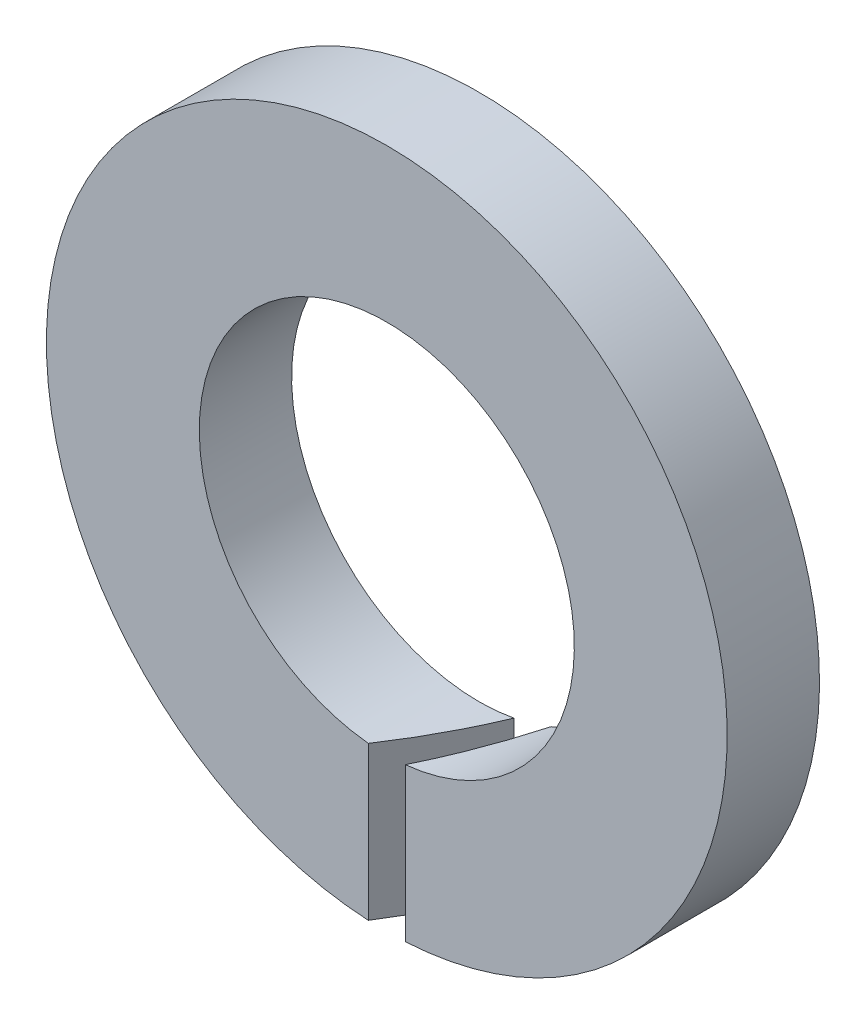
ISO-10303-21;
HEADER;
FILE_DESCRIPTION(('STEP AP214'),'2;1');
FILE_NAME('part.step','',(''),(''),'','','');
FILE_SCHEMA(('AUTOMOTIVE_DESIGN { 1 0 10303 214 1 1 1 1 }'));
ENDSEC;
DATA;
#1=APPLICATION_CONTEXT('core data for automotive mechanical design processes');
#2=APPLICATION_PROTOCOL_DEFINITION('international standard','automotive_design',2000,#1);
#3=PRODUCT_CONTEXT('',#1,'mechanical');
#4=PRODUCT('Part','Part','',(#3));
#5=PRODUCT_RELATED_PRODUCT_CATEGORY('part','',(#4));
#6=PRODUCT_DEFINITION_FORMATION('','',#4);
#7=PRODUCT_DEFINITION_CONTEXT('part definition',#1,'design');
#8=PRODUCT_DEFINITION('design','',#6,#7);
#9=PRODUCT_DEFINITION_SHAPE('','',#8);
#10=(LENGTH_UNIT() NAMED_UNIT(*) SI_UNIT(.MILLI.,.METRE.));
#11=(NAMED_UNIT(*) PLANE_ANGLE_UNIT() SI_UNIT($,.RADIAN.));
#12=(NAMED_UNIT(*) SI_UNIT($,.STERADIAN.) SOLID_ANGLE_UNIT());
#13=UNCERTAINTY_MEASURE_WITH_UNIT(LENGTH_MEASURE(1.E-05),#10,'distance_accuracy_value','');
#14=(GEOMETRIC_REPRESENTATION_CONTEXT(3) GLOBAL_UNCERTAINTY_ASSIGNED_CONTEXT((#13)) GLOBAL_UNIT_ASSIGNED_CONTEXT((#10,
#11,#12)) REPRESENTATION_CONTEXT('',''));
#15=CARTESIAN_POINT('',(0.,0.,0.));
#16=DIRECTION('',(0.,0.,1.));
#17=DIRECTION('',(1.,0.,0.));
#18=AXIS2_PLACEMENT_3D('',#15,#16,#17);
#19=CARTESIAN_POINT('',(0.,0.,-7.9));
#20=DIRECTION('',(0.,0.,-1.));
#21=DIRECTION('',(-1.,0.,0.));
#22=AXIS2_PLACEMENT_3D('',#19,#20,#21);
#23=CYLINDRICAL_SURFACE('',#22,3.25);
#24=CARTESIAN_POINT('',(0.,0.,-7.9));
#25=DIRECTION('',(0.,0.,-1.));
#26=DIRECTION('',(-1.,0.,0.));
#27=AXIS2_PLACEMENT_3D('',#24,#25,#26);
#28=CIRCLE('',#27,3.25);
#29=CARTESIAN_POINT('',(-0.319999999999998,-3.23420778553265,-7.9));
#30=VERTEX_POINT('',#29);
#31=CARTESIAN_POINT('',(0.319999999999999,-3.23420778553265,-7.9));
#32=VERTEX_POINT('',#31);
#33=EDGE_CURVE('E20',#30,#32,#28,.T.);
#34=ORIENTED_EDGE('',*,*,#33,.F.);
#35=CARTESIAN_POINT('',(0.,0.,-8.45425625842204));
#36=DIRECTION('',(0.866025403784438,0.,0.500000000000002));
#37=DIRECTION('',(0.500000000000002,0.,-0.866025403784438));
#38=AXIS2_PLACEMENT_3D('',#35,#36,#37);
#39=ELLIPSE('',#38,6.49999999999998,3.25);
#40=CARTESIAN_POINT('',(0.603760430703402,-3.19342658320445,-9.5));
#41=VERTEX_POINT('',#40);
#42=EDGE_CURVE('E59',#41,#30,#39,.F.);
#43=ORIENTED_EDGE('',*,*,#42,.F.);
#44=CARTESIAN_POINT('',(0.,0.,-9.5));
#45=DIRECTION('',(0.,0.,-1.));
#46=DIRECTION('',(-1.,0.,0.));
#47=AXIS2_PLACEMENT_3D('',#44,#45,#46);
#48=CIRCLE('',#47,3.25);
#49=CARTESIAN_POINT('',(1.2437604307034,-3.00259221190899,-9.5));
#50=VERTEX_POINT('',#49);
#51=EDGE_CURVE('E71',#50,#41,#48,.F.);
#52=ORIENTED_EDGE('',*,*,#51,.F.);
#53=CARTESIAN_POINT('',(0.,0.,-7.34574374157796));
#54=DIRECTION('',(-0.866025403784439,0.,-0.499999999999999));
#55=DIRECTION('',(0.499999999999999,0.,-0.866025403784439));
#56=AXIS2_PLACEMENT_3D('',#53,#54,#55);
#57=ELLIPSE('',#56,6.50000000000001,3.25);
#58=EDGE_CURVE('E60',#32,#50,#57,.F.);
#59=ORIENTED_EDGE('',*,*,#58,.F.);
#60=EDGE_LOOP('',(#34,#43,#52,#59));
#61=FACE_BOUND('',#60,.T.);
#62=ADVANCED_FACE('F16',(#61),#23,.F.);
#63=CARTESIAN_POINT('',(-6.06360257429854,5.91,-7.9));
#64=DIRECTION('',(0.,0.,1.));
#65=DIRECTION('',(0.,-1.,0.));
#66=AXIS2_PLACEMENT_3D('',#63,#64,#65);
#67=PLANE('',#66);
#68=DIRECTION('',(0.,1.,0.));
#69=VECTOR('',#68,1.);
#70=CARTESIAN_POINT('',(0.319999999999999,-4.44695392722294,-7.9));
#71=LINE('',#70,#69);
#72=CARTESIAN_POINT('',(0.319999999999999,-5.8913156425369,-7.9));
#73=VERTEX_POINT('',#72);
#74=EDGE_CURVE('E77',#73,#32,#71,.T.);
#75=ORIENTED_EDGE('',*,*,#74,.F.);
#76=CARTESIAN_POINT('',(0.,0.,-7.9));
#77=DIRECTION('',(0.,0.,1.));
#78=DIRECTION('',(1.,0.,0.));
#79=AXIS2_PLACEMENT_3D('',#76,#77,#78);
#80=CIRCLE('',#79,5.9);
#81=CARTESIAN_POINT('',(-0.319999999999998,-5.8913156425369,-7.9));
#82=VERTEX_POINT('',#81);
#83=EDGE_CURVE('E67',#82,#73,#80,.F.);
#84=ORIENTED_EDGE('',*,*,#83,.F.);
#85=DIRECTION('',(0.,-1.,0.));
#86=VECTOR('',#85,1.);
#87=CARTESIAN_POINT('',(-0.319999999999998,-4.55493891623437,-7.9));
#88=LINE('',#87,#86);
#89=EDGE_CURVE('E64',#30,#82,#88,.T.);
#90=ORIENTED_EDGE('',*,*,#89,.F.);
#91=ORIENTED_EDGE('',*,*,#33,.T.);
#92=EDGE_LOOP('',(#75,#84,#90,#91));
#93=FACE_BOUND('',#92,.T.);
#94=ADVANCED_FACE('F65',(#93),#67,.T.);
#95=CARTESIAN_POINT('',(0.315000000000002,-5.9013156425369,-7.89133974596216));
#96=DIRECTION('',(-0.866025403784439,0.,-0.499999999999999));
#97=DIRECTION('',(0.,1.,0.));
#98=AXIS2_PLACEMENT_3D('',#95,#96,#97);
#99=PLANE('',#98);
#100=CARTESIAN_POINT('',(0.,0.,-7.34574374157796));
#101=DIRECTION('',(-0.866025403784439,0.,-0.499999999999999));
#102=DIRECTION('',(-0.499999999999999,0.,0.866025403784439));
#103=AXIS2_PLACEMENT_3D('',#100,#101,#102);
#104=ELLIPSE('',#103,11.8,5.9);
#105=CARTESIAN_POINT('',(1.2437604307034,-5.76741363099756,-9.5));
#106=VERTEX_POINT('',#105);
#107=EDGE_CURVE('E85',#73,#106,#104,.F.);
#108=ORIENTED_EDGE('',*,*,#107,.F.);
#109=ORIENTED_EDGE('',*,*,#74,.T.);
#110=ORIENTED_EDGE('',*,*,#58,.T.);
#111=DIRECTION('',(0.,1.,0.));
#112=VECTOR('',#111,1.);
#113=CARTESIAN_POINT('',(1.2437604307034,0.135336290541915,-9.5));
#114=LINE('',#113,#112);
#115=EDGE_CURVE('E73',#106,#50,#114,.T.);
#116=ORIENTED_EDGE('',*,*,#115,.F.);
#117=EDGE_LOOP('',(#108,#109,#110,#116));
#118=FACE_BOUND('',#117,.T.);
#119=ADVANCED_FACE('F90',(#118),#99,.T.);
#120=CARTESIAN_POINT('',(-6.604248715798,-6.46642418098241,-9.5));
#121=DIRECTION('',(0.,0.,-1.));
#122=DIRECTION('',(0.,1.,0.));
#123=AXIS2_PLACEMENT_3D('',#120,#121,#122);
#124=PLANE('',#123);
#125=ORIENTED_EDGE('',*,*,#115,.T.);
#126=ORIENTED_EDGE('',*,*,#51,.T.);
#127=DIRECTION('',(0.,1.,0.));
#128=VECTOR('',#127,1.);
#129=CARTESIAN_POINT('',(0.603760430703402,-4.55493891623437,-9.5));
#130=LINE('',#129,#128);
#131=CARTESIAN_POINT('',(0.603760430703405,-5.86902660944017,-9.50000000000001));
#132=VERTEX_POINT('',#131);
#133=EDGE_CURVE('E35',#132,#41,#130,.T.);
#134=ORIENTED_EDGE('',*,*,#133,.F.);
#135=CARTESIAN_POINT('',(0.,0.,-9.5));
#136=DIRECTION('',(0.,0.,1.));
#137=DIRECTION('',(1.,0.,0.));
#138=AXIS2_PLACEMENT_3D('',#135,#136,#137);
#139=CIRCLE('',#138,5.9);
#140=EDGE_CURVE('E26',#106,#132,#139,.T.);
#141=ORIENTED_EDGE('',*,*,#140,.F.);
#142=EDGE_LOOP('',(#125,#126,#134,#141));
#143=FACE_BOUND('',#142,.T.);
#144=ADVANCED_FACE('F89',(#143),#124,.T.);
#145=CARTESIAN_POINT('',(-0.325000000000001,-3.18342658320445,-7.89133974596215));
#146=DIRECTION('',(0.866025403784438,0.,0.500000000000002));
#147=DIRECTION('',(0.,-1.,0.));
#148=AXIS2_PLACEMENT_3D('',#145,#146,#147);
#149=PLANE('',#148);
#150=CARTESIAN_POINT('',(0.,0.,-8.45425625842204));
#151=DIRECTION('',(0.866025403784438,0.,0.500000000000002));
#152=DIRECTION('',(-0.500000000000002,0.,0.866025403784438));
#153=AXIS2_PLACEMENT_3D('',#150,#151,#152);
#154=ELLIPSE('',#153,11.8,5.9);
#155=EDGE_CURVE('E11',#132,#82,#154,.F.);
#156=ORIENTED_EDGE('',*,*,#155,.F.);
#157=ORIENTED_EDGE('',*,*,#133,.T.);
#158=ORIENTED_EDGE('',*,*,#42,.T.);
#159=ORIENTED_EDGE('',*,*,#89,.T.);
#160=EDGE_LOOP('',(#156,#157,#158,#159));
#161=FACE_BOUND('',#160,.T.);
#162=ADVANCED_FACE('F70',(#161),#149,.T.);
#163=CARTESIAN_POINT('',(0.,0.,-9.5));
#164=DIRECTION('',(0.,0.,1.));
#165=DIRECTION('',(1.,0.,0.));
#166=AXIS2_PLACEMENT_3D('',#163,#164,#165);
#167=CYLINDRICAL_SURFACE('',#166,5.9);
#168=ORIENTED_EDGE('',*,*,#140,.T.);
#169=ORIENTED_EDGE('',*,*,#155,.T.);
#170=ORIENTED_EDGE('',*,*,#83,.T.);
#171=ORIENTED_EDGE('',*,*,#107,.T.);
#172=EDGE_LOOP('',(#168,#169,#170,#171));
#173=FACE_BOUND('',#172,.T.);
#174=ADVANCED_FACE('F18',(#173),#167,.T.);
#175=CLOSED_SHELL('',(#62,#94,#119,#144,#162,#174));
#176=MANIFOLD_SOLID_BREP('B1',#175);
#177=ADVANCED_BREP_SHAPE_REPRESENTATION('',(#18,#176),#14);
#178=SHAPE_DEFINITION_REPRESENTATION(#9,#177);
ENDSEC;
END-ISO-10303-21;
